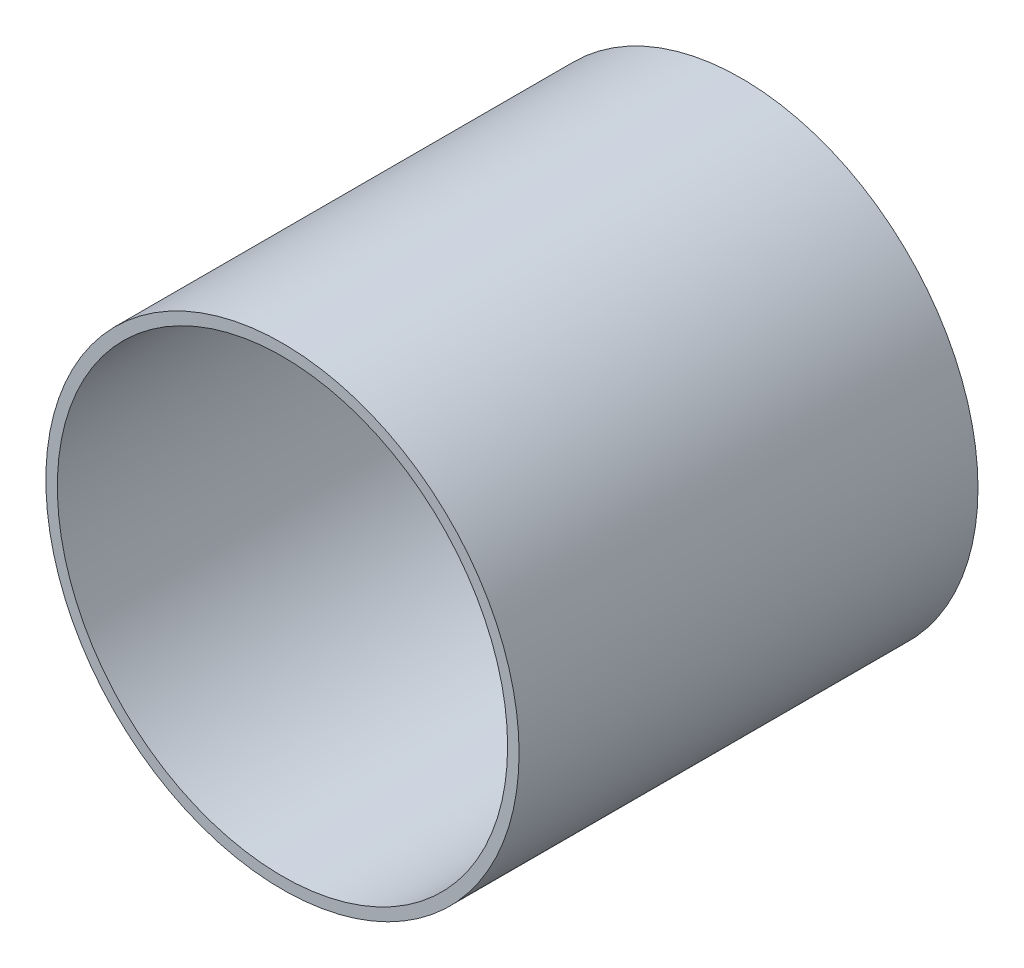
ISO-10303-21;
HEADER;
FILE_DESCRIPTION(('STEP AP214'),'2;1');
FILE_NAME('part.step','',(''),(''),'','','');
FILE_SCHEMA(('AUTOMOTIVE_DESIGN { 1 0 10303 214 1 1 1 1 }'));
ENDSEC;
DATA;
#1=APPLICATION_CONTEXT('core data for automotive mechanical design processes');
#2=APPLICATION_PROTOCOL_DEFINITION('international standard','automotive_design',2000,#1);
#3=PRODUCT_CONTEXT('',#1,'mechanical');
#4=PRODUCT('Part','Part','',(#3));
#5=PRODUCT_RELATED_PRODUCT_CATEGORY('part','',(#4));
#6=PRODUCT_DEFINITION_FORMATION('','',#4);
#7=PRODUCT_DEFINITION_CONTEXT('part definition',#1,'design');
#8=PRODUCT_DEFINITION('design','',#6,#7);
#9=PRODUCT_DEFINITION_SHAPE('','',#8);
#10=(LENGTH_UNIT() NAMED_UNIT(*) SI_UNIT(.MILLI.,.METRE.));
#11=(NAMED_UNIT(*) PLANE_ANGLE_UNIT() SI_UNIT($,.RADIAN.));
#12=(NAMED_UNIT(*) SI_UNIT($,.STERADIAN.) SOLID_ANGLE_UNIT());
#13=UNCERTAINTY_MEASURE_WITH_UNIT(LENGTH_MEASURE(1.E-05),#10,'distance_accuracy_value','');
#14=(GEOMETRIC_REPRESENTATION_CONTEXT(3) GLOBAL_UNCERTAINTY_ASSIGNED_CONTEXT((#13)) GLOBAL_UNIT_ASSIGNED_CONTEXT((#10,
#11,#12)) REPRESENTATION_CONTEXT('',''));
#15=CARTESIAN_POINT('',(0.,0.,0.));
#16=DIRECTION('',(0.,0.,1.));
#17=DIRECTION('',(1.,0.,0.));
#18=AXIS2_PLACEMENT_3D('',#15,#16,#17);
#19=CARTESIAN_POINT('',(0.,0.,160.));
#20=DIRECTION('',(0.,0.,1.));
#21=DIRECTION('',(1.,0.,0.));
#22=AXIS2_PLACEMENT_3D('',#19,#20,#21);
#23=PLANE('',#22);
#24=CARTESIAN_POINT('',(0.,0.,160.));
#25=DIRECTION('',(0.,0.,1.));
#26=DIRECTION('',(1.,0.,0.));
#27=AXIS2_PLACEMENT_3D('',#24,#25,#26);
#28=CIRCLE('',#27,82.5);
#29=CARTESIAN_POINT('',(82.5,0.,160.));
#30=VERTEX_POINT('',#29);
#31=EDGE_CURVE('E10',#30,#30,#28,.T.);
#32=ORIENTED_EDGE('',*,*,#31,.T.);
#33=EDGE_LOOP('',(#32));
#34=FACE_BOUND('',#33,.T.);
#35=CARTESIAN_POINT('',(0.,0.,160.));
#36=DIRECTION('',(0.,0.,1.));
#37=DIRECTION('',(1.,0.,0.));
#38=AXIS2_PLACEMENT_3D('',#35,#36,#37);
#39=CIRCLE('',#38,78.5);
#40=CARTESIAN_POINT('',(78.5,0.,160.));
#41=VERTEX_POINT('',#40);
#42=EDGE_CURVE('E48',#41,#41,#39,.T.);
#43=ORIENTED_EDGE('',*,*,#42,.F.);
#44=EDGE_LOOP('',(#43));
#45=FACE_BOUND('',#44,.T.);
#46=ADVANCED_FACE('F34',(#34,#45),#23,.T.);
#47=CARTESIAN_POINT('',(0.,0.,0.));
#48=DIRECTION('',(0.,0.,1.));
#49=DIRECTION('',(1.,0.,0.));
#50=AXIS2_PLACEMENT_3D('',#47,#48,#49);
#51=PLANE('',#50);
#52=CARTESIAN_POINT('',(0.,0.,0.));
#53=DIRECTION('',(0.,0.,1.));
#54=DIRECTION('',(1.,0.,0.));
#55=AXIS2_PLACEMENT_3D('',#52,#53,#54);
#56=CIRCLE('',#55,82.5);
#57=CARTESIAN_POINT('',(82.5,0.,0.));
#58=VERTEX_POINT('',#57);
#59=EDGE_CURVE('E38',#58,#58,#56,.T.);
#60=ORIENTED_EDGE('',*,*,#59,.F.);
#61=EDGE_LOOP('',(#60));
#62=FACE_BOUND('',#61,.T.);
#63=CARTESIAN_POINT('',(0.,0.,0.));
#64=DIRECTION('',(0.,0.,1.));
#65=DIRECTION('',(1.,0.,0.));
#66=AXIS2_PLACEMENT_3D('',#63,#64,#65);
#67=CIRCLE('',#66,78.5);
#68=CARTESIAN_POINT('',(78.5,0.,0.));
#69=VERTEX_POINT('',#68);
#70=EDGE_CURVE('E50',#69,#69,#67,.T.);
#71=ORIENTED_EDGE('',*,*,#70,.T.);
#72=EDGE_LOOP('',(#71));
#73=FACE_BOUND('',#72,.T.);
#74=ADVANCED_FACE('F63',(#62,#73),#51,.F.);
#75=CARTESIAN_POINT('',(0.,0.,160.));
#76=DIRECTION('',(0.,0.,-1.));
#77=DIRECTION('',(-1.,0.,0.));
#78=AXIS2_PLACEMENT_3D('',#75,#76,#77);
#79=CYLINDRICAL_SURFACE('',#78,82.5);
#80=ORIENTED_EDGE('',*,*,#31,.F.);
#81=EDGE_LOOP('',(#80));
#82=FACE_BOUND('',#81,.T.);
#83=ORIENTED_EDGE('',*,*,#59,.T.);
#84=EDGE_LOOP('',(#83));
#85=FACE_BOUND('',#84,.T.);
#86=ADVANCED_FACE('F36',(#82,#85),#79,.T.);
#87=CARTESIAN_POINT('',(0.,0.,160.));
#88=DIRECTION('',(0.,0.,-1.));
#89=DIRECTION('',(-1.,0.,0.));
#90=AXIS2_PLACEMENT_3D('',#87,#88,#89);
#91=CYLINDRICAL_SURFACE('',#90,78.5);
#92=ORIENTED_EDGE('',*,*,#42,.T.);
#93=EDGE_LOOP('',(#92));
#94=FACE_BOUND('',#93,.T.);
#95=ORIENTED_EDGE('',*,*,#70,.F.);
#96=EDGE_LOOP('',(#95));
#97=FACE_BOUND('',#96,.T.);
#98=ADVANCED_FACE('F59',(#94,#97),#91,.F.);
#99=CLOSED_SHELL('',(#46,#74,#86,#98));
#100=MANIFOLD_SOLID_BREP('B2',#99);
#101=ADVANCED_BREP_SHAPE_REPRESENTATION('',(#18,#100),#14);
#102=SHAPE_DEFINITION_REPRESENTATION(#9,#101);
ENDSEC;
END-ISO-10303-21;
